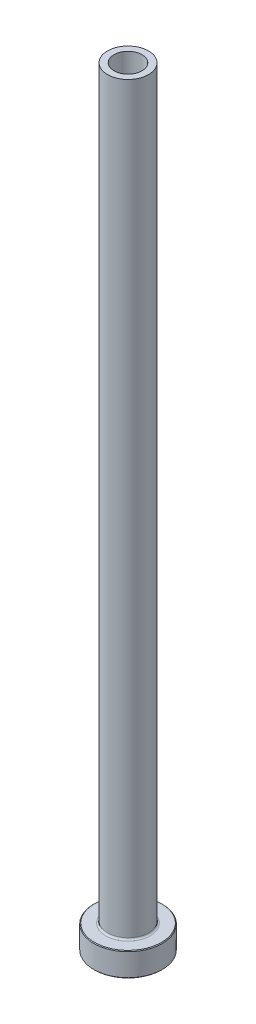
ISO-10303-21;
HEADER;
FILE_DESCRIPTION(('STEP AP214'),'2;1');
FILE_NAME('part.step','',(''),(''),'','','');
FILE_SCHEMA(('AUTOMOTIVE_DESIGN { 1 0 10303 214 1 1 1 1 }'));
ENDSEC;
DATA;
#1=APPLICATION_CONTEXT('core data for automotive mechanical design processes');
#2=APPLICATION_PROTOCOL_DEFINITION('international standard','automotive_design',2000,#1);
#3=PRODUCT_CONTEXT('',#1,'mechanical');
#4=PRODUCT('Part','Part','',(#3));
#5=PRODUCT_RELATED_PRODUCT_CATEGORY('part','',(#4));
#6=PRODUCT_DEFINITION_FORMATION('','',#4);
#7=PRODUCT_DEFINITION_CONTEXT('part definition',#1,'design');
#8=PRODUCT_DEFINITION('design','',#6,#7);
#9=PRODUCT_DEFINITION_SHAPE('','',#8);
#10=(LENGTH_UNIT() NAMED_UNIT(*) SI_UNIT(.MILLI.,.METRE.));
#11=(NAMED_UNIT(*) PLANE_ANGLE_UNIT() SI_UNIT($,.RADIAN.));
#12=(NAMED_UNIT(*) SI_UNIT($,.STERADIAN.) SOLID_ANGLE_UNIT());
#13=UNCERTAINTY_MEASURE_WITH_UNIT(LENGTH_MEASURE(1.E-05),#10,'distance_accuracy_value','');
#14=(GEOMETRIC_REPRESENTATION_CONTEXT(3) GLOBAL_UNCERTAINTY_ASSIGNED_CONTEXT((#13)) GLOBAL_UNIT_ASSIGNED_CONTEXT((#10,
#11,#12)) REPRESENTATION_CONTEXT('',''));
#15=CARTESIAN_POINT('',(0.,0.,0.));
#16=DIRECTION('',(0.,0.,1.));
#17=DIRECTION('',(1.,0.,0.));
#18=AXIS2_PLACEMENT_3D('',#15,#16,#17);
#19=CARTESIAN_POINT('',(0.,92.1876809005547,0.));
#20=DIRECTION('',(0.,1.,0.));
#21=DIRECTION('',(0.,0.,1.));
#22=AXIS2_PLACEMENT_3D('',#19,#20,#21);
#23=CYLINDRICAL_SURFACE('',#22,4.10000000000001);
#24=CARTESIAN_POINT('',(0.,225.,0.));
#25=DIRECTION('',(0.,1.,0.));
#26=DIRECTION('',(0.,0.,1.));
#27=AXIS2_PLACEMENT_3D('',#24,#25,#26);
#28=CIRCLE('',#27,4.10000000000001);
#29=CARTESIAN_POINT('',(0.,225.,4.10000000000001));
#30=VERTEX_POINT('',#29);
#31=EDGE_CURVE('E62',#30,#30,#28,.T.);
#32=ORIENTED_EDGE('',*,*,#31,.T.);
#33=EDGE_LOOP('',(#32));
#34=FACE_BOUND('',#33,.T.);
#35=CARTESIAN_POINT('',(0.,180.,0.));
#36=DIRECTION('',(0.,1.,0.));
#37=DIRECTION('',(0.,0.,1.));
#38=AXIS2_PLACEMENT_3D('',#35,#36,#37);
#39=CIRCLE('',#38,4.10000000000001);
#40=CARTESIAN_POINT('',(0.,180.,4.10000000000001));
#41=VERTEX_POINT('',#40);
#42=EDGE_CURVE('E71',#41,#41,#39,.T.);
#43=ORIENTED_EDGE('',*,*,#42,.F.);
#44=EDGE_LOOP('',(#43));
#45=FACE_BOUND('',#44,.T.);
#46=ADVANCED_FACE('F30',(#34,#45),#23,.F.);
#47=CARTESIAN_POINT('',(-4.10000000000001,225.,0.));
#48=DIRECTION('',(0.,1.,0.));
#49=DIRECTION('',(0.,0.,1.));
#50=AXIS2_PLACEMENT_3D('',#47,#48,#49);
#51=PLANE('',#50);
#52=CARTESIAN_POINT('',(0.,225.,0.));
#53=DIRECTION('',(0.,1.,0.));
#54=DIRECTION('',(0.,0.,1.));
#55=AXIS2_PLACEMENT_3D('',#52,#53,#54);
#56=CIRCLE('',#55,6.00000000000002);
#57=CARTESIAN_POINT('',(0.,225.,6.00000000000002));
#58=VERTEX_POINT('',#57);
#59=EDGE_CURVE('E65',#58,#58,#56,.T.);
#60=ORIENTED_EDGE('',*,*,#59,.T.);
#61=EDGE_LOOP('',(#60));
#62=FACE_BOUND('',#61,.T.);
#63=ORIENTED_EDGE('',*,*,#31,.F.);
#64=EDGE_LOOP('',(#63));
#65=FACE_BOUND('',#64,.T.);
#66=ADVANCED_FACE('F79',(#62,#65),#51,.T.);
#67=CARTESIAN_POINT('',(0.,92.1876809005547,0.));
#68=DIRECTION('',(0.,1.,0.));
#69=DIRECTION('',(0.,0.,1.));
#70=AXIS2_PLACEMENT_3D('',#67,#68,#69);
#71=CYLINDRICAL_SURFACE('',#70,6.);
#72=CARTESIAN_POINT('',(0.,7.50000000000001,0.));
#73=DIRECTION('',(0.,1.,0.));
#74=DIRECTION('',(0.,0.,1.));
#75=AXIS2_PLACEMENT_3D('',#72,#73,#74);
#76=CIRCLE('',#75,6.);
#77=CARTESIAN_POINT('',(0.,7.50000000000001,6.));
#78=VERTEX_POINT('',#77);
#79=EDGE_CURVE('E59',#78,#78,#76,.T.);
#80=ORIENTED_EDGE('',*,*,#79,.T.);
#81=EDGE_LOOP('',(#80));
#82=FACE_BOUND('',#81,.T.);
#83=ORIENTED_EDGE('',*,*,#59,.F.);
#84=EDGE_LOOP('',(#83));
#85=FACE_BOUND('',#84,.T.);
#86=ADVANCED_FACE('F85',(#82,#85),#71,.T.);
#87=CARTESIAN_POINT('',(-5.99999999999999,7.,0.));
#88=DIRECTION('',(0.,1.,0.));
#89=DIRECTION('',(0.,0.,1.));
#90=AXIS2_PLACEMENT_3D('',#87,#88,#89);
#91=PLANE('',#90);
#92=CARTESIAN_POINT('',(0.,7.,0.));
#93=DIRECTION('',(0.,1.,0.));
#94=DIRECTION('',(0.,0.,1.));
#95=AXIS2_PLACEMENT_3D('',#92,#93,#94);
#96=CIRCLE('',#95,9.80000000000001);
#97=CARTESIAN_POINT('',(0.,7.,-9.80000000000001));
#98=VERTEX_POINT('',#97);
#99=EDGE_CURVE('E53',#98,#98,#96,.T.);
#100=ORIENTED_EDGE('',*,*,#99,.T.);
#101=EDGE_LOOP('',(#100));
#102=FACE_BOUND('',#101,.T.);
#103=CARTESIAN_POINT('',(0.,7.,0.));
#104=DIRECTION('',(0.,1.,0.));
#105=DIRECTION('',(0.,0.,1.));
#106=AXIS2_PLACEMENT_3D('',#103,#104,#105);
#107=CIRCLE('',#106,6.5);
#108=CARTESIAN_POINT('',(0.,7.,6.5));
#109=VERTEX_POINT('',#108);
#110=EDGE_CURVE('E56',#109,#109,#107,.F.);
#111=ORIENTED_EDGE('',*,*,#110,.T.);
#112=EDGE_LOOP('',(#111));
#113=FACE_BOUND('',#112,.T.);
#114=ADVANCED_FACE('F111',(#102,#113),#91,.T.);
#115=CARTESIAN_POINT('',(0.,92.1876809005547,0.));
#116=DIRECTION('',(0.,1.,0.));
#117=DIRECTION('',(0.,0.,1.));
#118=AXIS2_PLACEMENT_3D('',#115,#116,#117);
#119=CYLINDRICAL_SURFACE('',#118,9.99999999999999);
#120=CARTESIAN_POINT('',(0.,6.80000000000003,0.));
#121=DIRECTION('',(0.,1.,0.));
#122=DIRECTION('',(0.,0.,1.));
#123=AXIS2_PLACEMENT_3D('',#120,#121,#122);
#124=CIRCLE('',#123,9.99999999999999);
#125=CARTESIAN_POINT('',(0.,6.80000000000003,-9.99999999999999));
#126=VERTEX_POINT('',#125);
#127=EDGE_CURVE('E45',#126,#126,#124,.F.);
#128=ORIENTED_EDGE('',*,*,#127,.T.);
#129=EDGE_LOOP('',(#128));
#130=FACE_BOUND('',#129,.T.);
#131=CARTESIAN_POINT('',(0.,0.200000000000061,0.));
#132=DIRECTION('',(0.,-1.,0.));
#133=DIRECTION('',(0.,0.,-1.));
#134=AXIS2_PLACEMENT_3D('',#131,#132,#133);
#135=CIRCLE('',#134,9.99999999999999);
#136=CARTESIAN_POINT('',(0.,0.200000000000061,-9.99999999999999));
#137=VERTEX_POINT('',#136);
#138=EDGE_CURVE('E50',#137,#137,#135,.F.);
#139=ORIENTED_EDGE('',*,*,#138,.T.);
#140=EDGE_LOOP('',(#139));
#141=FACE_BOUND('',#140,.T.);
#142=ADVANCED_FACE('F108',(#130,#141),#119,.T.);
#143=CARTESIAN_POINT('',(-9.99999999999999,0.,0.));
#144=DIRECTION('',(0.,-1.,0.));
#145=DIRECTION('',(0.,0.,-1.));
#146=AXIS2_PLACEMENT_3D('',#143,#144,#145);
#147=PLANE('',#146);
#148=CARTESIAN_POINT('',(0.,0.,0.));
#149=DIRECTION('',(0.,-1.,0.));
#150=DIRECTION('',(0.,0.,-1.));
#151=AXIS2_PLACEMENT_3D('',#148,#149,#150);
#152=CIRCLE('',#151,4.85000000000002);
#153=CARTESIAN_POINT('',(0.,0.,-4.85000000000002));
#154=VERTEX_POINT('',#153);
#155=EDGE_CURVE('E37',#154,#154,#152,.F.);
#156=ORIENTED_EDGE('',*,*,#155,.T.);
#157=EDGE_LOOP('',(#156));
#158=FACE_BOUND('',#157,.T.);
#159=CARTESIAN_POINT('',(0.,0.,0.));
#160=DIRECTION('',(0.,-1.,0.));
#161=DIRECTION('',(0.,0.,-1.));
#162=AXIS2_PLACEMENT_3D('',#159,#160,#161);
#163=CIRCLE('',#162,9.79999999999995);
#164=CARTESIAN_POINT('',(0.,0.,-9.79999999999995));
#165=VERTEX_POINT('',#164);
#166=EDGE_CURVE('E41',#165,#165,#163,.T.);
#167=ORIENTED_EDGE('',*,*,#166,.T.);
#168=EDGE_LOOP('',(#167));
#169=FACE_BOUND('',#168,.T.);
#170=ADVANCED_FACE('F110',(#158,#169),#147,.T.);
#171=CARTESIAN_POINT('',(0.,92.1876809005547,0.));
#172=DIRECTION('',(0.,1.,0.));
#173=DIRECTION('',(0.,0.,1.));
#174=AXIS2_PLACEMENT_3D('',#171,#172,#173);
#175=CYLINDRICAL_SURFACE('',#174,4.35);
#176=CARTESIAN_POINT('',(0.,0.500000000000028,0.));
#177=DIRECTION('',(0.,-1.,0.));
#178=DIRECTION('',(0.,0.,-1.));
#179=AXIS2_PLACEMENT_3D('',#176,#177,#178);
#180=CIRCLE('',#179,4.35);
#181=CARTESIAN_POINT('',(0.,0.500000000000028,-4.35));
#182=VERTEX_POINT('',#181);
#183=EDGE_CURVE('E10',#182,#182,#180,.T.);
#184=ORIENTED_EDGE('',*,*,#183,.T.);
#185=EDGE_LOOP('',(#184));
#186=FACE_BOUND('',#185,.T.);
#187=CARTESIAN_POINT('',(0.,168.,0.));
#188=DIRECTION('',(0.,1.,0.));
#189=DIRECTION('',(0.,0.,1.));
#190=AXIS2_PLACEMENT_3D('',#187,#188,#189);
#191=CIRCLE('',#190,4.35000000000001);
#192=CARTESIAN_POINT('',(0.,168.,4.35000000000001));
#193=VERTEX_POINT('',#192);
#194=EDGE_CURVE('E68',#193,#193,#191,.T.);
#195=ORIENTED_EDGE('',*,*,#194,.T.);
#196=EDGE_LOOP('',(#195));
#197=FACE_BOUND('',#196,.T.);
#198=ADVANCED_FACE('F118',(#186,#197),#175,.F.);
#199=CARTESIAN_POINT('',(0.,168.,0.));
#200=DIRECTION('',(0.,-1.,0.));
#201=DIRECTION('',(0.,0.,-1.));
#202=AXIS2_PLACEMENT_3D('',#199,#200,#201);
#203=CONICAL_SURFACE('',#202,4.35000000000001,0.0208303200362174);
#204=ORIENTED_EDGE('',*,*,#42,.T.);
#205=EDGE_LOOP('',(#204));
#206=FACE_BOUND('',#205,.T.);
#207=ORIENTED_EDGE('',*,*,#194,.F.);
#208=EDGE_LOOP('',(#207));
#209=FACE_BOUND('',#208,.T.);
#210=ADVANCED_FACE('F75',(#206,#209),#203,.F.);
#211=CARTESIAN_POINT('',(0.,7.50000000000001,0.));
#212=DIRECTION('',(0.,1.,0.));
#213=DIRECTION('',(0.,0.,1.));
#214=AXIS2_PLACEMENT_3D('',#211,#212,#213);
#215=TOROIDAL_SURFACE('',#214,6.5,0.5);
#216=ORIENTED_EDGE('',*,*,#110,.F.);
#217=EDGE_LOOP('',(#216));
#218=FACE_BOUND('',#217,.T.);
#219=ORIENTED_EDGE('',*,*,#79,.F.);
#220=EDGE_LOOP('',(#219));
#221=FACE_BOUND('',#220,.T.);
#222=ADVANCED_FACE('F90',(#218,#221),#215,.F.);
#223=CARTESIAN_POINT('',(0.,7.00000000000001,0.));
#224=DIRECTION('',(0.,-1.,0.));
#225=DIRECTION('',(0.,0.,-1.));
#226=AXIS2_PLACEMENT_3D('',#223,#224,#225);
#227=CONICAL_SURFACE('',#226,9.8,0.785398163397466);
#228=CARTESIAN_POINT('',(0.,6.80000000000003,-9.99999999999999));
#229=CARTESIAN_POINT('',(0.,6.80208333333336,-9.99791666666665));
#230=CARTESIAN_POINT('',(0.,6.80416666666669,-9.99583333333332));
#231=CARTESIAN_POINT('',(0.,6.80833333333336,-9.99166666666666));
#232=CARTESIAN_POINT('',(0.,6.81041666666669,-9.98958333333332));
#233=CARTESIAN_POINT('',(0.,6.81458333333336,-9.98541666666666));
#234=CARTESIAN_POINT('',(0.,6.81666666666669,-9.98333333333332));
#235=CARTESIAN_POINT('',(0.,6.82083333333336,-9.97916666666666));
#236=CARTESIAN_POINT('',(0.,6.82291666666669,-9.97708333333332));
#237=CARTESIAN_POINT('',(0.,6.82708333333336,-9.97291666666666));
#238=CARTESIAN_POINT('',(0.,6.82916666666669,-9.97083333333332));
#239=CARTESIAN_POINT('',(0.,6.83333333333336,-9.96666666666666));
#240=CARTESIAN_POINT('',(0.,6.83541666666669,-9.96458333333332));
#241=CARTESIAN_POINT('',(0.,6.83958333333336,-9.96041666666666));
#242=CARTESIAN_POINT('',(0.,6.84166666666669,-9.95833333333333));
#243=CARTESIAN_POINT('',(0.,6.84583333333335,-9.95416666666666));
#244=CARTESIAN_POINT('',(0.,6.84791666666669,-9.95208333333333));
#245=CARTESIAN_POINT('',(0.,6.85208333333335,-9.94791666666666));
#246=CARTESIAN_POINT('',(0.,6.85416666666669,-9.94583333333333));
#247=CARTESIAN_POINT('',(0.,6.85833333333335,-9.94166666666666));
#248=CARTESIAN_POINT('',(0.,6.86041666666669,-9.93958333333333));
#249=CARTESIAN_POINT('',(0.,6.86458333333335,-9.93541666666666));
#250=CARTESIAN_POINT('',(0.,6.86666666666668,-9.93333333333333));
#251=CARTESIAN_POINT('',(0.,6.87083333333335,-9.92916666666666));
#252=CARTESIAN_POINT('',(0.,6.87291666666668,-9.92708333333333));
#253=CARTESIAN_POINT('',(0.,6.87708333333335,-9.92291666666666));
#254=CARTESIAN_POINT('',(0.,6.87916666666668,-9.92083333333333));
#255=CARTESIAN_POINT('',(0.,6.88333333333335,-9.91666666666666));
#256=CARTESIAN_POINT('',(0.,6.88541666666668,-9.91458333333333));
#257=CARTESIAN_POINT('',(0.,6.88958333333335,-9.91041666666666));
#258=CARTESIAN_POINT('',(0.,6.89166666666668,-9.90833333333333));
#259=CARTESIAN_POINT('',(0.,6.89583333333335,-9.90416666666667));
#260=CARTESIAN_POINT('',(0.,6.89791666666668,-9.90208333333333));
#261=CARTESIAN_POINT('',(0.,6.90208333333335,-9.89791666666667));
#262=CARTESIAN_POINT('',(0.,6.90416666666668,-9.89583333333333));
#263=CARTESIAN_POINT('',(0.,6.90833333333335,-9.89166666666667));
#264=CARTESIAN_POINT('',(0.,6.91041666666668,-9.88958333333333));
#265=CARTESIAN_POINT('',(0.,6.91458333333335,-9.88541666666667));
#266=CARTESIAN_POINT('',(0.,6.91666666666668,-9.88333333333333));
#267=CARTESIAN_POINT('',(0.,6.92083333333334,-9.87916666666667));
#268=CARTESIAN_POINT('',(0.,6.92291666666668,-9.87708333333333));
#269=CARTESIAN_POINT('',(0.,6.92708333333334,-9.87291666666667));
#270=CARTESIAN_POINT('',(0.,6.92916666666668,-9.87083333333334));
#271=CARTESIAN_POINT('',(0.,6.93333333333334,-9.86666666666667));
#272=CARTESIAN_POINT('',(0.,6.93541666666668,-9.86458333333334));
#273=CARTESIAN_POINT('',(0.,6.93958333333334,-9.86041666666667));
#274=CARTESIAN_POINT('',(0.,6.94166666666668,-9.85833333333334));
#275=CARTESIAN_POINT('',(0.,6.94583333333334,-9.85416666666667));
#276=CARTESIAN_POINT('',(0.,6.94791666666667,-9.85208333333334));
#277=CARTESIAN_POINT('',(0.,6.95208333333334,-9.84791666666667));
#278=CARTESIAN_POINT('',(0.,6.95416666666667,-9.84583333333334));
#279=CARTESIAN_POINT('',(0.,6.95833333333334,-9.84166666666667));
#280=CARTESIAN_POINT('',(0.,6.96041666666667,-9.83958333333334));
#281=CARTESIAN_POINT('',(0.,6.96458333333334,-9.83541666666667));
#282=CARTESIAN_POINT('',(0.,6.96666666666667,-9.83333333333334));
#283=CARTESIAN_POINT('',(0.,6.97083333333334,-9.82916666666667));
#284=CARTESIAN_POINT('',(0.,6.97291666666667,-9.82708333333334));
#285=CARTESIAN_POINT('',(0.,6.97708333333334,-9.82291666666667));
#286=CARTESIAN_POINT('',(0.,6.97916666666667,-9.82083333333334));
#287=CARTESIAN_POINT('',(0.,6.98333333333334,-9.81666666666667));
#288=CARTESIAN_POINT('',(0.,6.98541666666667,-9.81458333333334));
#289=CARTESIAN_POINT('',(0.,6.98958333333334,-9.81041666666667));
#290=CARTESIAN_POINT('',(0.,6.99166666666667,-9.80833333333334));
#291=CARTESIAN_POINT('',(0.,6.99583333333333,-9.80416666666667));
#292=CARTESIAN_POINT('',(0.,6.99791666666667,-9.80208333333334));
#293=CARTESIAN_POINT('',(0.,7.,-9.80000000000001));
#294=B_SPLINE_CURVE_WITH_KNOTS('',3,(#228,#229,#230,#231,#232,#233,#234,#235,#236,#237,#238,
#239,#240,#241,#242,#243,#244,#245,#246,#247,#248,#249,#250,#251,#252,#253,#254,#255,#256,#257,
#258,#259,#260,#261,#262,#263,#264,#265,#266,#267,#268,#269,#270,#271,#272,#273,#274,#275,#276,
#277,#278,#279,#280,#281,#282,#283,#284,#285,#286,#287,#288,#289,#290,#291,#292,#293),
.UNSPECIFIED.,.F.,.F.,(4,2,2,2,2,2,2,2,2,2,2,2,2,2,2,2,2,2,2,2,2,2,2,2,2,2,2,2,2,2,2,2,4),(0.,
0.00883883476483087,0.0176776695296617,0.0265165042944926,0.0353553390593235,0.0441941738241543,
0.0530330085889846,0.0618718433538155,0.0707106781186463,0.0795495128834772,0.0883883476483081,
0.0972271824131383,0.106066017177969,0.1149048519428,0.123743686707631,0.132582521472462,
0.141421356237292,0.150260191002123,0.159099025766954,0.167937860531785,0.176776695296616,
0.185615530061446,0.194454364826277,0.203293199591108,0.212132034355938,0.220970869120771,
0.229809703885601,0.238648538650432,0.247487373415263,0.256326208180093,0.265165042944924,
0.274003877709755,0.282842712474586),.UNSPECIFIED.);
#295=EDGE_CURVE('BSEAM93',#126,#98,#294,.T.);
#296=ORIENTED_EDGE('',*,*,#127,.F.);
#297=ORIENTED_EDGE('',*,*,#99,.F.);
#298=ORIENTED_EDGE('',*,*,#295,.T.);
#299=ORIENTED_EDGE('',*,*,#295,.F.);
#300=EDGE_LOOP('',(#296,#298,#297,#299));
#301=FACE_BOUND('',#300,.T.);
#302=ADVANCED_FACE('F93',(#301),#227,.T.);
#303=CARTESIAN_POINT('',(0.,0.200000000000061,0.));
#304=DIRECTION('',(0.,1.,0.));
#305=DIRECTION('',(0.,0.,1.));
#306=AXIS2_PLACEMENT_3D('',#303,#304,#305);
#307=CONICAL_SURFACE('',#306,9.99999999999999,0.785398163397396);
#308=ORIENTED_EDGE('',*,*,#166,.F.);
#309=EDGE_LOOP('',(#308));
#310=FACE_BOUND('',#309,.T.);
#311=ORIENTED_EDGE('',*,*,#138,.F.);
#312=EDGE_LOOP('',(#311));
#313=FACE_BOUND('',#312,.T.);
#314=ADVANCED_FACE('F96',(#310,#313),#307,.T.);
#315=CARTESIAN_POINT('',(0.,0.,0.));
#316=DIRECTION('',(0.,-1.,0.));
#317=DIRECTION('',(0.,0.,-1.));
#318=AXIS2_PLACEMENT_3D('',#315,#316,#317);
#319=CONICAL_SURFACE('',#318,4.85000000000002,0.785398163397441);
#320=ORIENTED_EDGE('',*,*,#183,.F.);
#321=EDGE_LOOP('',(#320));
#322=FACE_BOUND('',#321,.T.);
#323=ORIENTED_EDGE('',*,*,#155,.F.);
#324=EDGE_LOOP('',(#323));
#325=FACE_BOUND('',#324,.T.);
#326=ADVANCED_FACE('F32',(#322,#325),#319,.F.);
#327=CLOSED_SHELL('',(#46,#66,#86,#114,#142,#170,#198,#210,#222,#302,#314,#326));
#328=MANIFOLD_SOLID_BREP('B2',#327);
#329=ADVANCED_BREP_SHAPE_REPRESENTATION('',(#18,#328),#14);
#330=SHAPE_DEFINITION_REPRESENTATION(#9,#329);
ENDSEC;
END-ISO-10303-21;
